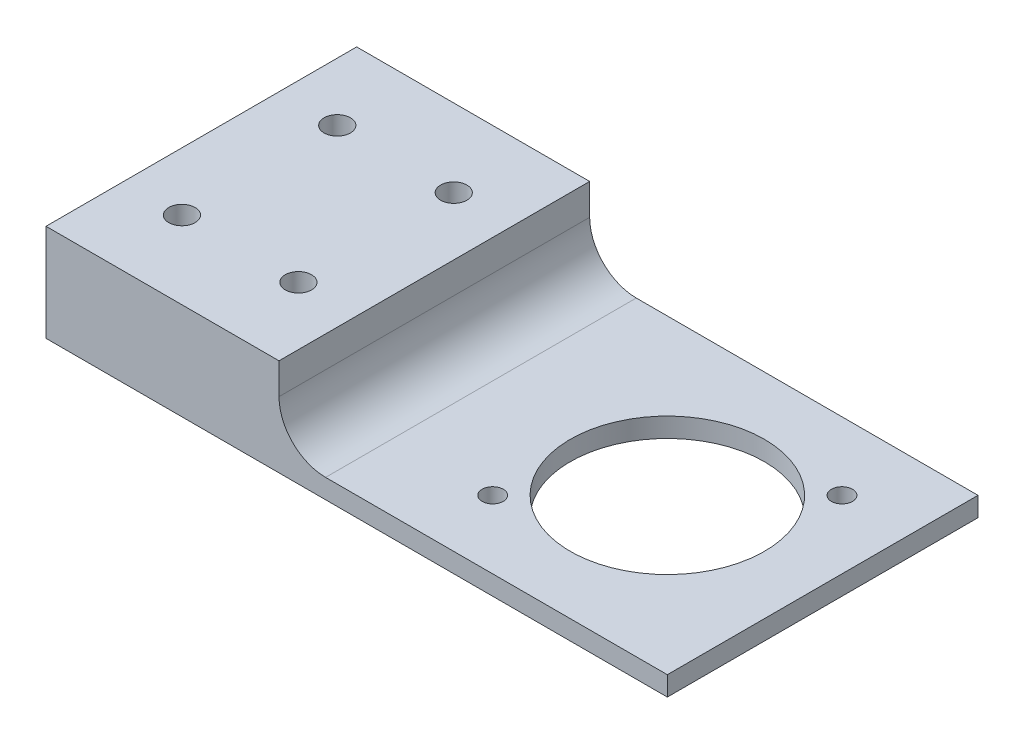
ISO-10303-21;
HEADER;
FILE_DESCRIPTION(('STEP AP214'),'2;1');
FILE_NAME('part.step','',(''),(''),'','','');
FILE_SCHEMA(('AUTOMOTIVE_DESIGN { 1 0 10303 214 1 1 1 1 }'));
ENDSEC;
DATA;
#1=APPLICATION_CONTEXT('core data for automotive mechanical design processes');
#2=APPLICATION_PROTOCOL_DEFINITION('international standard','automotive_design',2000,#1);
#3=PRODUCT_CONTEXT('',#1,'mechanical');
#4=PRODUCT('Part','Part','',(#3));
#5=PRODUCT_RELATED_PRODUCT_CATEGORY('part','',(#4));
#6=PRODUCT_DEFINITION_FORMATION('','',#4);
#7=PRODUCT_DEFINITION_CONTEXT('part definition',#1,'design');
#8=PRODUCT_DEFINITION('design','',#6,#7);
#9=PRODUCT_DEFINITION_SHAPE('','',#8);
#10=(LENGTH_UNIT() NAMED_UNIT(*) SI_UNIT(.MILLI.,.METRE.));
#11=(NAMED_UNIT(*) PLANE_ANGLE_UNIT() SI_UNIT($,.RADIAN.));
#12=(NAMED_UNIT(*) SI_UNIT($,.STERADIAN.) SOLID_ANGLE_UNIT());
#13=UNCERTAINTY_MEASURE_WITH_UNIT(LENGTH_MEASURE(1.E-05),#10,'distance_accuracy_value','');
#14=(GEOMETRIC_REPRESENTATION_CONTEXT(3) GLOBAL_UNCERTAINTY_ASSIGNED_CONTEXT((#13)) GLOBAL_UNIT_ASSIGNED_CONTEXT((#10,
#11,#12)) REPRESENTATION_CONTEXT('',''));
#15=CARTESIAN_POINT('',(0.,0.,0.));
#16=DIRECTION('',(0.,0.,1.));
#17=DIRECTION('',(1.,0.,0.));
#18=AXIS2_PLACEMENT_3D('',#15,#16,#17);
#19=CARTESIAN_POINT('',(0.,3.175,0.));
#20=DIRECTION('',(0.,-1.,0.));
#21=DIRECTION('',(0.,0.,-1.));
#22=AXIS2_PLACEMENT_3D('',#19,#20,#21);
#23=PLANE('',#22);
#24=CARTESIAN_POINT('',(52.3786072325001,3.175,-14.2786072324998));
#25=DIRECTION('',(0.,-1.,0.));
#26=DIRECTION('',(0.,0.,-1.));
#27=AXIS2_PLACEMENT_3D('',#24,#25,#26);
#28=CIRCLE('',#27,1.7272);
#29=CARTESIAN_POINT('',(52.3786072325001,3.175,-16.0058072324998));
#30=VERTEX_POINT('',#29);
#31=EDGE_CURVE('E364',#30,#30,#28,.F.);
#32=ORIENTED_EDGE('',*,*,#31,.F.);
#33=EDGE_LOOP('',(#32));
#34=FACE_BOUND('',#33,.T.);
#35=CARTESIAN_POINT('',(23.8213927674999,3.175,14.2786072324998));
#36=DIRECTION('',(0.,-1.,0.));
#37=DIRECTION('',(0.,0.,-1.));
#38=AXIS2_PLACEMENT_3D('',#35,#36,#37);
#39=CIRCLE('',#38,1.7272);
#40=CARTESIAN_POINT('',(23.8213927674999,3.175,12.5514072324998));
#41=VERTEX_POINT('',#40);
#42=EDGE_CURVE('E373',#41,#41,#39,.F.);
#43=ORIENTED_EDGE('',*,*,#42,.F.);
#44=EDGE_LOOP('',(#43));
#45=FACE_BOUND('',#44,.T.);
#46=CARTESIAN_POINT('',(38.1,3.175,0.));
#47=DIRECTION('',(0.,-1.,0.));
#48=DIRECTION('',(0.,0.,-1.));
#49=AXIS2_PLACEMENT_3D('',#46,#47,#48);
#50=CIRCLE('',#49,15.875);
#51=CARTESIAN_POINT('',(38.1,3.175,-15.875));
#52=VERTEX_POINT('',#51);
#53=EDGE_CURVE('E371',#52,#52,#50,.F.);
#54=ORIENTED_EDGE('',*,*,#53,.F.);
#55=EDGE_LOOP('',(#54));
#56=FACE_BOUND('',#55,.T.);
#57=DIRECTION('',(-1.,0.,0.));
#58=VECTOR('',#57,1.);
#59=CARTESIAN_POINT('',(-38.1,3.175,-25.4));
#60=LINE('',#59,#58);
#61=CARTESIAN_POINT('',(63.5,3.175,-25.4));
#62=VERTEX_POINT('',#61);
#63=CARTESIAN_POINT('',(7.61999999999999,3.175,-25.4));
#64=VERTEX_POINT('',#63);
#65=EDGE_CURVE('E143',#62,#64,#60,.T.);
#66=ORIENTED_EDGE('',*,*,#65,.T.);
#67=DIRECTION('',(0.,0.,-1.));
#68=VECTOR('',#67,1.);
#69=CARTESIAN_POINT('',(7.62,3.175,25.4));
#70=LINE('',#69,#68);
#71=CARTESIAN_POINT('',(7.62,3.175,25.4));
#72=VERTEX_POINT('',#71);
#73=EDGE_CURVE('E61',#64,#72,#70,.F.);
#74=ORIENTED_EDGE('',*,*,#73,.T.);
#75=DIRECTION('',(1.,0.,0.));
#76=VECTOR('',#75,1.);
#77=CARTESIAN_POINT('',(-38.1,3.175,25.4));
#78=LINE('',#77,#76);
#79=CARTESIAN_POINT('',(63.5,3.175,25.4));
#80=VERTEX_POINT('',#79);
#81=EDGE_CURVE('E146',#72,#80,#78,.T.);
#82=ORIENTED_EDGE('',*,*,#81,.T.);
#83=DIRECTION('',(0.,0.,-1.));
#84=VECTOR('',#83,1.);
#85=CARTESIAN_POINT('',(63.5,3.175,-25.4));
#86=LINE('',#85,#84);
#87=EDGE_CURVE('E150',#80,#62,#86,.T.);
#88=ORIENTED_EDGE('',*,*,#87,.T.);
#89=EDGE_LOOP('',(#66,#74,#82,#88));
#90=FACE_BOUND('',#89,.T.);
#91=ADVANCED_FACE('F39',(#34,#45,#56,#90),#23,.F.);
#92=CARTESIAN_POINT('',(-38.1,3.175,-25.4));
#93=DIRECTION('',(1.,0.,0.));
#94=DIRECTION('',(0.,0.,-1.));
#95=AXIS2_PLACEMENT_3D('',#92,#93,#94);
#96=PLANE('',#95);
#97=DIRECTION('',(0.,0.,1.));
#98=VECTOR('',#97,1.);
#99=CARTESIAN_POINT('',(-38.1,0.,-25.4));
#100=LINE('',#99,#98);
#101=CARTESIAN_POINT('',(-38.1,0.,-25.4));
#102=VERTEX_POINT('',#101);
#103=CARTESIAN_POINT('',(-38.1,0.,25.4));
#104=VERTEX_POINT('',#103);
#105=EDGE_CURVE('E105',#102,#104,#100,.T.);
#106=ORIENTED_EDGE('',*,*,#105,.T.);
#107=DIRECTION('',(0.,-1.,0.));
#108=VECTOR('',#107,1.);
#109=CARTESIAN_POINT('',(-38.1,3.175,25.4));
#110=LINE('',#109,#108);
#111=CARTESIAN_POINT('',(-38.1,15.875,25.4));
#112=VERTEX_POINT('',#111);
#113=EDGE_CURVE('E98',#112,#104,#110,.T.);
#114=ORIENTED_EDGE('',*,*,#113,.F.);
#115=DIRECTION('',(0.,0.,1.));
#116=VECTOR('',#115,1.);
#117=CARTESIAN_POINT('',(-38.1,15.875,-25.4));
#118=LINE('',#117,#116);
#119=CARTESIAN_POINT('',(-38.1,15.875,-25.4));
#120=VERTEX_POINT('',#119);
#121=EDGE_CURVE('E103',#120,#112,#118,.T.);
#122=ORIENTED_EDGE('',*,*,#121,.F.);
#123=DIRECTION('',(0.,-1.,0.));
#124=VECTOR('',#123,1.);
#125=CARTESIAN_POINT('',(-38.1,3.175,-25.4));
#126=LINE('',#125,#124);
#127=EDGE_CURVE('E108',#120,#102,#126,.T.);
#128=ORIENTED_EDGE('',*,*,#127,.T.);
#129=EDGE_LOOP('',(#106,#114,#122,#128));
#130=FACE_BOUND('',#129,.T.);
#131=ADVANCED_FACE('F100',(#130),#96,.F.);
#132=CARTESIAN_POINT('',(63.5,3.175,25.4));
#133=DIRECTION('',(0.,0.,-1.));
#134=DIRECTION('',(-1.,0.,0.));
#135=AXIS2_PLACEMENT_3D('',#132,#133,#134);
#136=PLANE('',#135);
#137=DIRECTION('',(1.,0.,0.));
#138=VECTOR('',#137,1.);
#139=CARTESIAN_POINT('',(63.5,0.,25.4));
#140=LINE('',#139,#138);
#141=CARTESIAN_POINT('',(63.5,0.,25.4));
#142=VERTEX_POINT('',#141);
#143=EDGE_CURVE('E157',#104,#142,#140,.T.);
#144=ORIENTED_EDGE('',*,*,#143,.T.);
#145=DIRECTION('',(0.,-1.,0.));
#146=VECTOR('',#145,1.);
#147=CARTESIAN_POINT('',(63.5,3.175,25.4));
#148=LINE('',#147,#146);
#149=EDGE_CURVE('E109',#80,#142,#148,.T.);
#150=ORIENTED_EDGE('',*,*,#149,.F.);
#151=ORIENTED_EDGE('',*,*,#81,.F.);
#152=CARTESIAN_POINT('',(7.62,10.795,25.4));
#153=DIRECTION('',(0.,0.,-1.));
#154=DIRECTION('',(-1.,0.,0.));
#155=AXIS2_PLACEMENT_3D('',#152,#153,#154);
#156=CIRCLE('',#155,7.62);
#157=CARTESIAN_POINT('',(0.,10.795,25.4));
#158=VERTEX_POINT('',#157);
#159=EDGE_CURVE('E11',#72,#158,#156,.T.);
#160=ORIENTED_EDGE('',*,*,#159,.T.);
#161=DIRECTION('',(0.,-1.,0.));
#162=VECTOR('',#161,1.);
#163=CARTESIAN_POINT('',(0.,15.875,25.4));
#164=LINE('',#163,#162);
#165=CARTESIAN_POINT('',(0.,15.875,25.4));
#166=VERTEX_POINT('',#165);
#167=EDGE_CURVE('E115',#166,#158,#164,.T.);
#168=ORIENTED_EDGE('',*,*,#167,.F.);
#169=DIRECTION('',(1.,0.,0.));
#170=VECTOR('',#169,1.);
#171=CARTESIAN_POINT('',(-38.1,15.875,25.4));
#172=LINE('',#171,#170);
#173=EDGE_CURVE('E112',#112,#166,#172,.T.);
#174=ORIENTED_EDGE('',*,*,#173,.F.);
#175=ORIENTED_EDGE('',*,*,#113,.T.);
#176=EDGE_LOOP('',(#144,#150,#151,#160,#168,#174,#175));
#177=FACE_BOUND('',#176,.T.);
#178=ADVANCED_FACE('F113',(#177),#136,.F.);
#179=CARTESIAN_POINT('',(63.5,3.175,-25.4));
#180=DIRECTION('',(-1.,0.,0.));
#181=DIRECTION('',(0.,0.,1.));
#182=AXIS2_PLACEMENT_3D('',#179,#180,#181);
#183=PLANE('',#182);
#184=DIRECTION('',(0.,0.,-1.));
#185=VECTOR('',#184,1.);
#186=CARTESIAN_POINT('',(63.5,0.,-25.4));
#187=LINE('',#186,#185);
#188=CARTESIAN_POINT('',(63.5,0.,-25.4));
#189=VERTEX_POINT('',#188);
#190=EDGE_CURVE('E160',#142,#189,#187,.T.);
#191=ORIENTED_EDGE('',*,*,#190,.T.);
#192=DIRECTION('',(0.,-1.,0.));
#193=VECTOR('',#192,1.);
#194=CARTESIAN_POINT('',(63.5,3.175,-25.4));
#195=LINE('',#194,#193);
#196=EDGE_CURVE('E154',#62,#189,#195,.T.);
#197=ORIENTED_EDGE('',*,*,#196,.F.);
#198=ORIENTED_EDGE('',*,*,#87,.F.);
#199=ORIENTED_EDGE('',*,*,#149,.T.);
#200=EDGE_LOOP('',(#191,#197,#198,#199));
#201=FACE_BOUND('',#200,.T.);
#202=ADVANCED_FACE('F194',(#201),#183,.F.);
#203=CARTESIAN_POINT('',(50.8,3.175,-25.4));
#204=DIRECTION('',(0.,0.,1.));
#205=DIRECTION('',(1.,0.,0.));
#206=AXIS2_PLACEMENT_3D('',#203,#204,#205);
#207=PLANE('',#206);
#208=DIRECTION('',(-1.,0.,0.));
#209=VECTOR('',#208,1.);
#210=CARTESIAN_POINT('',(50.8,0.,-25.4));
#211=LINE('',#210,#209);
#212=EDGE_CURVE('E147',#189,#102,#211,.T.);
#213=ORIENTED_EDGE('',*,*,#212,.T.);
#214=ORIENTED_EDGE('',*,*,#127,.F.);
#215=DIRECTION('',(-1.,0.,0.));
#216=VECTOR('',#215,1.);
#217=CARTESIAN_POINT('',(-38.1,15.875,-25.4));
#218=LINE('',#217,#216);
#219=CARTESIAN_POINT('',(0.,15.875,-25.4));
#220=VERTEX_POINT('',#219);
#221=EDGE_CURVE('E124',#220,#120,#218,.T.);
#222=ORIENTED_EDGE('',*,*,#221,.F.);
#223=DIRECTION('',(0.,-1.,0.));
#224=VECTOR('',#223,1.);
#225=CARTESIAN_POINT('',(0.,15.875,-25.4));
#226=LINE('',#225,#224);
#227=CARTESIAN_POINT('',(0.,10.795,-25.4));
#228=VERTEX_POINT('',#227);
#229=EDGE_CURVE('E138',#220,#228,#226,.T.);
#230=ORIENTED_EDGE('',*,*,#229,.T.);
#231=CARTESIAN_POINT('',(7.62,10.795,-25.4));
#232=DIRECTION('',(0.,0.,1.));
#233=DIRECTION('',(1.,0.,0.));
#234=AXIS2_PLACEMENT_3D('',#231,#232,#233);
#235=CIRCLE('',#234,7.62);
#236=EDGE_CURVE('E48',#228,#64,#235,.T.);
#237=ORIENTED_EDGE('',*,*,#236,.T.);
#238=ORIENTED_EDGE('',*,*,#65,.F.);
#239=ORIENTED_EDGE('',*,*,#196,.T.);
#240=EDGE_LOOP('',(#213,#214,#222,#230,#237,#238,#239));
#241=FACE_BOUND('',#240,.T.);
#242=ADVANCED_FACE('F186',(#241),#207,.F.);
#243=CARTESIAN_POINT('',(0.,0.,0.));
#244=DIRECTION('',(0.,-1.,0.));
#245=DIRECTION('',(0.,0.,-1.));
#246=AXIS2_PLACEMENT_3D('',#243,#244,#245);
#247=PLANE('',#246);
#248=CARTESIAN_POINT('',(52.3786072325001,0.,-14.2786072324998));
#249=DIRECTION('',(0.,-1.,0.));
#250=DIRECTION('',(0.,0.,-1.));
#251=AXIS2_PLACEMENT_3D('',#248,#249,#250);
#252=CIRCLE('',#251,1.7272);
#253=CARTESIAN_POINT('',(52.3786072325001,0.,-16.0058072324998));
#254=VERTEX_POINT('',#253);
#255=EDGE_CURVE('E362',#254,#254,#252,.T.);
#256=ORIENTED_EDGE('',*,*,#255,.F.);
#257=EDGE_LOOP('',(#256));
#258=FACE_BOUND('',#257,.T.);
#259=CARTESIAN_POINT('',(23.8213927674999,0.,14.2786072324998));
#260=DIRECTION('',(0.,-1.,0.));
#261=DIRECTION('',(0.,0.,-1.));
#262=AXIS2_PLACEMENT_3D('',#259,#260,#261);
#263=CIRCLE('',#262,1.7272);
#264=CARTESIAN_POINT('',(23.8213927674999,0.,12.5514072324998));
#265=VERTEX_POINT('',#264);
#266=EDGE_CURVE('E376',#265,#265,#263,.T.);
#267=ORIENTED_EDGE('',*,*,#266,.F.);
#268=EDGE_LOOP('',(#267));
#269=FACE_BOUND('',#268,.T.);
#270=CARTESIAN_POINT('',(38.1,0.,0.));
#271=DIRECTION('',(0.,-1.,0.));
#272=DIRECTION('',(0.,0.,-1.));
#273=AXIS2_PLACEMENT_3D('',#270,#271,#272);
#274=CIRCLE('',#273,15.875);
#275=CARTESIAN_POINT('',(38.1,0.,-15.875));
#276=VERTEX_POINT('',#275);
#277=EDGE_CURVE('E366',#276,#276,#274,.T.);
#278=ORIENTED_EDGE('',*,*,#277,.F.);
#279=EDGE_LOOP('',(#278));
#280=FACE_BOUND('',#279,.T.);
#281=CARTESIAN_POINT('',(-28.575,0.,-12.7));
#282=DIRECTION('',(0.,-1.,0.));
#283=DIRECTION('',(0.,0.,1.));
#284=AXIS2_PLACEMENT_3D('',#281,#282,#283);
#285=CIRCLE('',#284,2.15265);
#286=CARTESIAN_POINT('',(-28.575,0.,-10.54735));
#287=VERTEX_POINT('',#286);
#288=EDGE_CURVE('E395',#287,#287,#285,.T.);
#289=ORIENTED_EDGE('',*,*,#288,.F.);
#290=EDGE_LOOP('',(#289));
#291=FACE_BOUND('',#290,.T.);
#292=CARTESIAN_POINT('',(-9.525,0.,12.7));
#293=DIRECTION('',(0.,-1.,0.));
#294=DIRECTION('',(0.,0.,-1.));
#295=AXIS2_PLACEMENT_3D('',#292,#293,#294);
#296=CIRCLE('',#295,2.15265);
#297=CARTESIAN_POINT('',(-9.525,0.,10.54735));
#298=VERTEX_POINT('',#297);
#299=EDGE_CURVE('E394',#298,#298,#296,.T.);
#300=ORIENTED_EDGE('',*,*,#299,.F.);
#301=EDGE_LOOP('',(#300));
#302=FACE_BOUND('',#301,.T.);
#303=CARTESIAN_POINT('',(-28.575,0.,12.7));
#304=DIRECTION('',(0.,-1.,0.));
#305=DIRECTION('',(0.,0.,-1.));
#306=AXIS2_PLACEMENT_3D('',#303,#304,#305);
#307=CIRCLE('',#306,2.15265);
#308=CARTESIAN_POINT('',(-28.575,0.,10.54735));
#309=VERTEX_POINT('',#308);
#310=EDGE_CURVE('E386',#309,#309,#307,.T.);
#311=ORIENTED_EDGE('',*,*,#310,.F.);
#312=EDGE_LOOP('',(#311));
#313=FACE_BOUND('',#312,.T.);
#314=CARTESIAN_POINT('',(-9.525,0.,-12.7));
#315=DIRECTION('',(0.,-1.,0.));
#316=DIRECTION('',(0.,0.,1.));
#317=AXIS2_PLACEMENT_3D('',#314,#315,#316);
#318=CIRCLE('',#317,2.15265);
#319=CARTESIAN_POINT('',(-9.525,0.,-10.54735));
#320=VERTEX_POINT('',#319);
#321=EDGE_CURVE('E130',#320,#320,#318,.T.);
#322=ORIENTED_EDGE('',*,*,#321,.F.);
#323=EDGE_LOOP('',(#322));
#324=FACE_BOUND('',#323,.T.);
#325=ORIENTED_EDGE('',*,*,#105,.F.);
#326=ORIENTED_EDGE('',*,*,#212,.F.);
#327=ORIENTED_EDGE('',*,*,#190,.F.);
#328=ORIENTED_EDGE('',*,*,#143,.F.);
#329=EDGE_LOOP('',(#325,#326,#327,#328));
#330=FACE_BOUND('',#329,.T.);
#331=ADVANCED_FACE('F190',(#258,#269,#280,#291,#302,#313,#324,#330),#247,.T.);
#332=CARTESIAN_POINT('',(0.,15.875,-25.4));
#333=DIRECTION('',(-1.,0.,0.));
#334=DIRECTION('',(0.,0.,1.));
#335=AXIS2_PLACEMENT_3D('',#332,#333,#334);
#336=PLANE('',#335);
#337=ORIENTED_EDGE('',*,*,#167,.T.);
#338=DIRECTION('',(0.,0.,-1.));
#339=VECTOR('',#338,1.);
#340=CARTESIAN_POINT('',(0.,10.795,-25.4));
#341=LINE('',#340,#339);
#342=EDGE_CURVE('E174',#158,#228,#341,.T.);
#343=ORIENTED_EDGE('',*,*,#342,.T.);
#344=ORIENTED_EDGE('',*,*,#229,.F.);
#345=DIRECTION('',(0.,0.,-1.));
#346=VECTOR('',#345,1.);
#347=CARTESIAN_POINT('',(0.,15.875,-25.4));
#348=LINE('',#347,#346);
#349=EDGE_CURVE('E119',#166,#220,#348,.T.);
#350=ORIENTED_EDGE('',*,*,#349,.F.);
#351=EDGE_LOOP('',(#337,#343,#344,#350));
#352=FACE_BOUND('',#351,.T.);
#353=ADVANCED_FACE('F183',(#352),#336,.F.);
#354=CARTESIAN_POINT('',(0.,15.875,0.));
#355=DIRECTION('',(0.,1.,0.));
#356=DIRECTION('',(0.,0.,1.));
#357=AXIS2_PLACEMENT_3D('',#354,#355,#356);
#358=PLANE('',#357);
#359=CARTESIAN_POINT('',(-28.575,15.875,-12.7));
#360=DIRECTION('',(0.,1.,0.));
#361=DIRECTION('',(0.,0.,1.));
#362=AXIS2_PLACEMENT_3D('',#359,#360,#361);
#363=CIRCLE('',#362,2.15265);
#364=CARTESIAN_POINT('',(-28.575,15.875,-10.54735));
#365=VERTEX_POINT('',#364);
#366=EDGE_CURVE('E399',#365,#365,#363,.F.);
#367=ORIENTED_EDGE('',*,*,#366,.T.);
#368=EDGE_LOOP('',(#367));
#369=FACE_BOUND('',#368,.T.);
#370=CARTESIAN_POINT('',(-9.525,15.875,12.7));
#371=DIRECTION('',(0.,1.,0.));
#372=DIRECTION('',(0.,0.,1.));
#373=AXIS2_PLACEMENT_3D('',#370,#371,#372);
#374=CIRCLE('',#373,2.15265);
#375=CARTESIAN_POINT('',(-9.525,15.875,14.85265));
#376=VERTEX_POINT('',#375);
#377=EDGE_CURVE('E400',#376,#376,#374,.F.);
#378=ORIENTED_EDGE('',*,*,#377,.T.);
#379=EDGE_LOOP('',(#378));
#380=FACE_BOUND('',#379,.T.);
#381=CARTESIAN_POINT('',(-28.575,15.875,12.7));
#382=DIRECTION('',(0.,1.,0.));
#383=DIRECTION('',(0.,0.,1.));
#384=AXIS2_PLACEMENT_3D('',#381,#382,#383);
#385=CIRCLE('',#384,2.15265);
#386=CARTESIAN_POINT('',(-28.575,15.875,14.85265));
#387=VERTEX_POINT('',#386);
#388=EDGE_CURVE('E390',#387,#387,#385,.F.);
#389=ORIENTED_EDGE('',*,*,#388,.T.);
#390=EDGE_LOOP('',(#389));
#391=FACE_BOUND('',#390,.T.);
#392=CARTESIAN_POINT('',(-9.525,15.875,-12.7));
#393=DIRECTION('',(0.,1.,0.));
#394=DIRECTION('',(0.,0.,1.));
#395=AXIS2_PLACEMENT_3D('',#392,#393,#394);
#396=CIRCLE('',#395,2.15265);
#397=CARTESIAN_POINT('',(-9.525,15.875,-10.54735));
#398=VERTEX_POINT('',#397);
#399=EDGE_CURVE('E126',#398,#398,#396,.F.);
#400=ORIENTED_EDGE('',*,*,#399,.T.);
#401=EDGE_LOOP('',(#400));
#402=FACE_BOUND('',#401,.T.);
#403=ORIENTED_EDGE('',*,*,#121,.T.);
#404=ORIENTED_EDGE('',*,*,#173,.T.);
#405=ORIENTED_EDGE('',*,*,#349,.T.);
#406=ORIENTED_EDGE('',*,*,#221,.T.);
#407=EDGE_LOOP('',(#403,#404,#405,#406));
#408=FACE_BOUND('',#407,.T.);
#409=ADVANCED_FACE('F122',(#369,#380,#391,#402,#408),#358,.T.);
#410=CARTESIAN_POINT('',(7.62,10.795,-25.4));
#411=DIRECTION('',(0.,0.,1.));
#412=DIRECTION('',(1.,0.,0.));
#413=AXIS2_PLACEMENT_3D('',#410,#411,#412);
#414=CYLINDRICAL_SURFACE('',#413,7.62);
#415=ORIENTED_EDGE('',*,*,#159,.F.);
#416=ORIENTED_EDGE('',*,*,#73,.F.);
#417=ORIENTED_EDGE('',*,*,#236,.F.);
#418=ORIENTED_EDGE('',*,*,#342,.F.);
#419=EDGE_LOOP('',(#415,#416,#417,#418));
#420=FACE_BOUND('',#419,.T.);
#421=ADVANCED_FACE('F41',(#420),#414,.F.);
#422=CARTESIAN_POINT('',(-9.525,21.9636136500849,-12.7));
#423=DIRECTION('',(0.,-1.,0.));
#424=DIRECTION('',(0.,0.,-1.));
#425=AXIS2_PLACEMENT_3D('',#422,#423,#424);
#426=CYLINDRICAL_SURFACE('',#425,2.15265);
#427=ORIENTED_EDGE('',*,*,#321,.T.);
#428=EDGE_LOOP('',(#427));
#429=FACE_BOUND('',#428,.T.);
#430=ORIENTED_EDGE('',*,*,#399,.F.);
#431=EDGE_LOOP('',(#430));
#432=FACE_BOUND('',#431,.T.);
#433=ADVANCED_FACE('F196',(#429,#432),#426,.F.);
#434=CARTESIAN_POINT('',(-28.575,21.9636136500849,12.7));
#435=DIRECTION('',(0.,-1.,0.));
#436=DIRECTION('',(0.,0.,-1.));
#437=AXIS2_PLACEMENT_3D('',#434,#435,#436);
#438=CYLINDRICAL_SURFACE('',#437,2.15265);
#439=ORIENTED_EDGE('',*,*,#310,.T.);
#440=EDGE_LOOP('',(#439));
#441=FACE_BOUND('',#440,.T.);
#442=ORIENTED_EDGE('',*,*,#388,.F.);
#443=EDGE_LOOP('',(#442));
#444=FACE_BOUND('',#443,.T.);
#445=ADVANCED_FACE('F201',(#441,#444),#438,.F.);
#446=CARTESIAN_POINT('',(-9.525,21.9636136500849,12.7));
#447=DIRECTION('',(0.,-1.,0.));
#448=DIRECTION('',(0.,0.,-1.));
#449=AXIS2_PLACEMENT_3D('',#446,#447,#448);
#450=CYLINDRICAL_SURFACE('',#449,2.15265);
#451=ORIENTED_EDGE('',*,*,#299,.T.);
#452=EDGE_LOOP('',(#451));
#453=FACE_BOUND('',#452,.T.);
#454=ORIENTED_EDGE('',*,*,#377,.F.);
#455=EDGE_LOOP('',(#454));
#456=FACE_BOUND('',#455,.T.);
#457=ADVANCED_FACE('F267',(#453,#456),#450,.F.);
#458=CARTESIAN_POINT('',(-28.575,21.9636136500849,-12.7));
#459=DIRECTION('',(0.,-1.,0.));
#460=DIRECTION('',(0.,0.,-1.));
#461=AXIS2_PLACEMENT_3D('',#458,#459,#460);
#462=CYLINDRICAL_SURFACE('',#461,2.15265);
#463=ORIENTED_EDGE('',*,*,#288,.T.);
#464=EDGE_LOOP('',(#463));
#465=FACE_BOUND('',#464,.T.);
#466=ORIENTED_EDGE('',*,*,#366,.F.);
#467=EDGE_LOOP('',(#466));
#468=FACE_BOUND('',#467,.T.);
#469=ADVANCED_FACE('F277',(#465,#468),#462,.F.);
#470=CARTESIAN_POINT('',(38.1,15.876,0.));
#471=DIRECTION('',(0.,-1.,0.));
#472=DIRECTION('',(0.,0.,-1.));
#473=AXIS2_PLACEMENT_3D('',#470,#471,#472);
#474=CYLINDRICAL_SURFACE('',#473,15.875);
#475=ORIENTED_EDGE('',*,*,#277,.T.);
#476=EDGE_LOOP('',(#475));
#477=FACE_BOUND('',#476,.T.);
#478=ORIENTED_EDGE('',*,*,#53,.T.);
#479=EDGE_LOOP('',(#478));
#480=FACE_BOUND('',#479,.T.);
#481=ADVANCED_FACE('F287',(#477,#480),#474,.F.);
#482=CARTESIAN_POINT('',(23.8213927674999,15.876,14.2786072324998));
#483=DIRECTION('',(0.,-1.,0.));
#484=DIRECTION('',(0.,0.,-1.));
#485=AXIS2_PLACEMENT_3D('',#482,#483,#484);
#486=CYLINDRICAL_SURFACE('',#485,1.7272);
#487=ORIENTED_EDGE('',*,*,#266,.T.);
#488=EDGE_LOOP('',(#487));
#489=FACE_BOUND('',#488,.T.);
#490=ORIENTED_EDGE('',*,*,#42,.T.);
#491=EDGE_LOOP('',(#490));
#492=FACE_BOUND('',#491,.T.);
#493=ADVANCED_FACE('F296',(#489,#492),#486,.F.);
#494=CARTESIAN_POINT('',(52.3786072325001,15.876,-14.2786072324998));
#495=DIRECTION('',(0.,-1.,0.));
#496=DIRECTION('',(0.,0.,-1.));
#497=AXIS2_PLACEMENT_3D('',#494,#495,#496);
#498=CYLINDRICAL_SURFACE('',#497,1.7272);
#499=ORIENTED_EDGE('',*,*,#255,.T.);
#500=EDGE_LOOP('',(#499));
#501=FACE_BOUND('',#500,.T.);
#502=ORIENTED_EDGE('',*,*,#31,.T.);
#503=EDGE_LOOP('',(#502));
#504=FACE_BOUND('',#503,.T.);
#505=ADVANCED_FACE('F345',(#501,#504),#498,.F.);
#506=CLOSED_SHELL('',(#91,#131,#178,#202,#242,#331,#353,#409,#421,#433,#445,#457,#469,#481,#493,#505));
#507=MANIFOLD_SOLID_BREP('B2',#506);
#508=ADVANCED_BREP_SHAPE_REPRESENTATION('',(#18,#507),#14);
#509=SHAPE_DEFINITION_REPRESENTATION(#9,#508);
ENDSEC;
END-ISO-10303-21;
